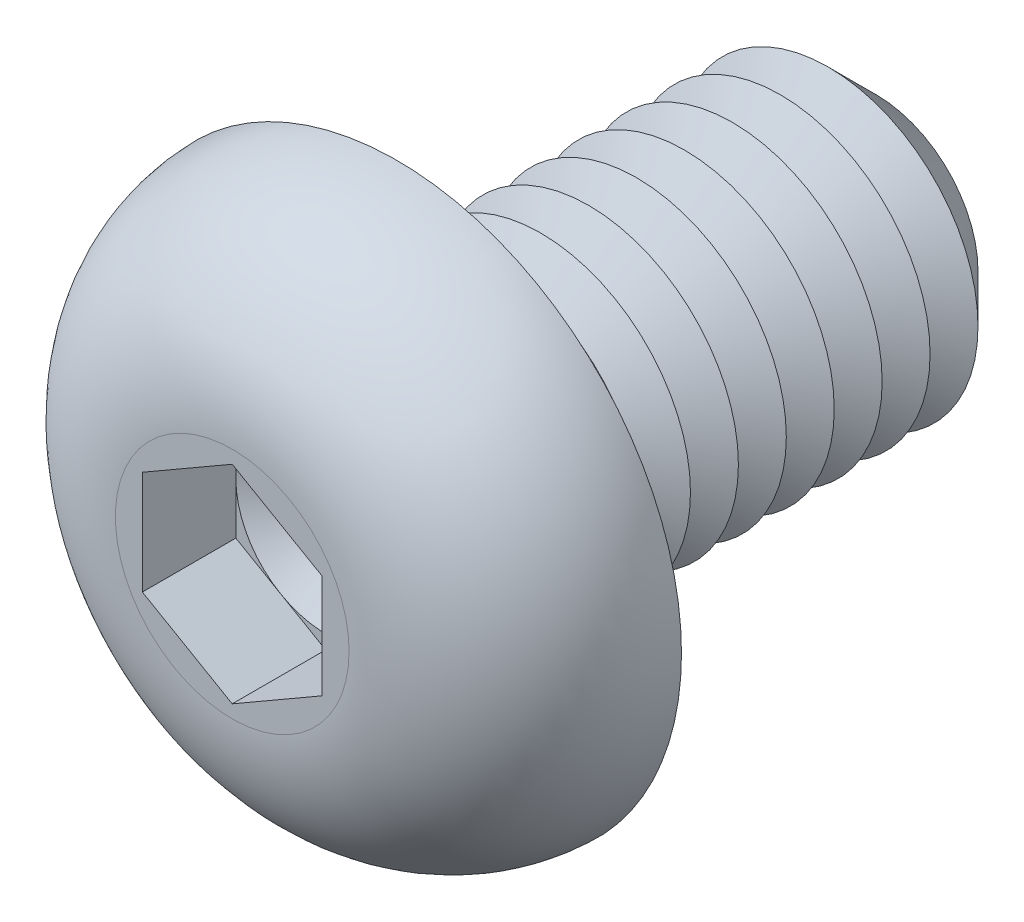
ISO-10303-21;
HEADER;
FILE_DESCRIPTION(('STEP AP214'),'2;1');
FILE_NAME('part.step','',(''),(''),'','','');
FILE_SCHEMA(('AUTOMOTIVE_DESIGN { 1 0 10303 214 1 1 1 1 }'));
ENDSEC;
DATA;
#1=APPLICATION_CONTEXT('core data for automotive mechanical design processes');
#2=APPLICATION_PROTOCOL_DEFINITION('international standard','automotive_design',2000,#1);
#3=PRODUCT_CONTEXT('',#1,'mechanical');
#4=PRODUCT('Part','Part','',(#3));
#5=PRODUCT_RELATED_PRODUCT_CATEGORY('part','',(#4));
#6=PRODUCT_DEFINITION_FORMATION('','',#4);
#7=PRODUCT_DEFINITION_CONTEXT('part definition',#1,'design');
#8=PRODUCT_DEFINITION('design','',#6,#7);
#9=PRODUCT_DEFINITION_SHAPE('','',#8);
#10=(LENGTH_UNIT() NAMED_UNIT(*) SI_UNIT(.MILLI.,.METRE.));
#11=(NAMED_UNIT(*) PLANE_ANGLE_UNIT() SI_UNIT($,.RADIAN.));
#12=(NAMED_UNIT(*) SI_UNIT($,.STERADIAN.) SOLID_ANGLE_UNIT());
#13=UNCERTAINTY_MEASURE_WITH_UNIT(LENGTH_MEASURE(1.E-05),#10,'distance_accuracy_value','');
#14=(GEOMETRIC_REPRESENTATION_CONTEXT(3) GLOBAL_UNCERTAINTY_ASSIGNED_CONTEXT((#13)) GLOBAL_UNIT_ASSIGNED_CONTEXT((#10,
#11,#12)) REPRESENTATION_CONTEXT('',''));
#15=CARTESIAN_POINT('',(0.,0.,0.));
#16=DIRECTION('',(0.,0.,1.));
#17=DIRECTION('',(1.,0.,0.));
#18=AXIS2_PLACEMENT_3D('',#15,#16,#17);
#19=CARTESIAN_POINT('',(0.,0.,1.19));
#20=DIRECTION('',(0.,0.,1.));
#21=DIRECTION('',(1.,0.,0.));
#22=AXIS2_PLACEMENT_3D('',#19,#20,#21);
#23=PLANE('',#22);
#24=CARTESIAN_POINT('',(0.,0.,1.19));
#25=DIRECTION('',(0.,0.,1.));
#26=DIRECTION('',(1.,0.,0.));
#27=AXIS2_PLACEMENT_3D('',#24,#25,#26);
#28=CIRCLE('',#27,1.5);
#29=CARTESIAN_POINT('',(1.5,0.,1.19));
#30=VERTEX_POINT('',#29);
#31=CARTESIAN_POINT('',(0.75,1.29903810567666,1.19));
#32=VERTEX_POINT('',#31);
#33=EDGE_CURVE('E117',#30,#32,#28,.T.);
#34=ORIENTED_EDGE('',*,*,#33,.F.);
#35=DIRECTION('',(0.,1.,0.));
#36=VECTOR('',#35,1.);
#37=CARTESIAN_POINT('',(1.5,-0.866025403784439,1.19));
#38=LINE('',#37,#36);
#39=CARTESIAN_POINT('',(1.5,0.86602540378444,1.19));
#40=VERTEX_POINT('',#39);
#41=EDGE_CURVE('E140',#30,#40,#38,.T.);
#42=ORIENTED_EDGE('',*,*,#41,.T.);
#43=DIRECTION('',(-0.866025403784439,0.5,0.));
#44=VECTOR('',#43,1.);
#45=CARTESIAN_POINT('',(1.5,0.86602540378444,1.19));
#46=LINE('',#45,#44);
#47=EDGE_CURVE('E135',#40,#32,#46,.T.);
#48=ORIENTED_EDGE('',*,*,#47,.T.);
#49=EDGE_LOOP('',(#34,#42,#48));
#50=FACE_BOUND('',#49,.T.);
#51=ADVANCED_FACE('F39',(#50),#23,.T.);
#52=CARTESIAN_POINT('',(0.,0.,1.19));
#53=DIRECTION('',(0.,0.,1.));
#54=DIRECTION('',(1.,0.,0.));
#55=AXIS2_PLACEMENT_3D('',#52,#53,#54);
#56=CIRCLE('',#55,1.5);
#57=CARTESIAN_POINT('',(-0.75,1.29903810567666,1.19));
#58=VERTEX_POINT('',#57);
#59=EDGE_CURVE('E11',#32,#58,#56,.T.);
#60=ORIENTED_EDGE('',*,*,#59,.F.);
#61=CARTESIAN_POINT('',(0.,1.73205080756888,1.19));
#62=VERTEX_POINT('',#61);
#63=EDGE_CURVE('E130',#32,#62,#46,.T.);
#64=ORIENTED_EDGE('',*,*,#63,.T.);
#65=DIRECTION('',(-0.866025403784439,-0.5,0.));
#66=VECTOR('',#65,1.);
#67=CARTESIAN_POINT('',(0.,1.73205080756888,1.19));
#68=LINE('',#67,#66);
#69=EDGE_CURVE('E132',#62,#58,#68,.T.);
#70=ORIENTED_EDGE('',*,*,#69,.T.);
#71=EDGE_LOOP('',(#60,#64,#70));
#72=FACE_BOUND('',#71,.T.);
#73=ADVANCED_FACE('F129',(#72),#23,.T.);
#74=CARTESIAN_POINT('',(-1.5,0.,1.19));
#75=VERTEX_POINT('',#74);
#76=EDGE_CURVE('E49',#58,#75,#56,.T.);
#77=ORIENTED_EDGE('',*,*,#76,.F.);
#78=CARTESIAN_POINT('',(-1.5,0.866025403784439,1.19));
#79=VERTEX_POINT('',#78);
#80=EDGE_CURVE('E143',#58,#79,#68,.T.);
#81=ORIENTED_EDGE('',*,*,#80,.T.);
#82=DIRECTION('',(0.,-1.,0.));
#83=VECTOR('',#82,1.);
#84=CARTESIAN_POINT('',(-1.5,0.866025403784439,1.19));
#85=LINE('',#84,#83);
#86=EDGE_CURVE('E154',#79,#75,#85,.T.);
#87=ORIENTED_EDGE('',*,*,#86,.T.);
#88=EDGE_LOOP('',(#77,#81,#87));
#89=FACE_BOUND('',#88,.T.);
#90=ADVANCED_FACE('F250',(#89),#23,.T.);
#91=CARTESIAN_POINT('',(-0.75,-1.29903810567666,1.19));
#92=VERTEX_POINT('',#91);
#93=EDGE_CURVE('E234',#75,#92,#56,.T.);
#94=ORIENTED_EDGE('',*,*,#93,.F.);
#95=CARTESIAN_POINT('',(-1.5,-0.866025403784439,1.19));
#96=VERTEX_POINT('',#95);
#97=EDGE_CURVE('E153',#75,#96,#85,.T.);
#98=ORIENTED_EDGE('',*,*,#97,.T.);
#99=DIRECTION('',(0.866025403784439,-0.5,0.));
#100=VECTOR('',#99,1.);
#101=CARTESIAN_POINT('',(-1.5,-0.866025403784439,1.19));
#102=LINE('',#101,#100);
#103=EDGE_CURVE('E159',#96,#92,#102,.T.);
#104=ORIENTED_EDGE('',*,*,#103,.T.);
#105=EDGE_LOOP('',(#94,#98,#104));
#106=FACE_BOUND('',#105,.T.);
#107=ADVANCED_FACE('F243',(#106),#23,.T.);
#108=CARTESIAN_POINT('',(0.75,-1.29903810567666,1.19));
#109=VERTEX_POINT('',#108);
#110=EDGE_CURVE('E56',#92,#109,#56,.T.);
#111=ORIENTED_EDGE('',*,*,#110,.F.);
#112=CARTESIAN_POINT('',(0.,-1.73205080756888,1.19));
#113=VERTEX_POINT('',#112);
#114=EDGE_CURVE('E158',#92,#113,#102,.T.);
#115=ORIENTED_EDGE('',*,*,#114,.T.);
#116=DIRECTION('',(0.866025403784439,0.5,0.));
#117=VECTOR('',#116,1.);
#118=CARTESIAN_POINT('',(0.,-1.73205080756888,1.19));
#119=LINE('',#118,#117);
#120=EDGE_CURVE('E164',#113,#109,#119,.T.);
#121=ORIENTED_EDGE('',*,*,#120,.T.);
#122=EDGE_LOOP('',(#111,#115,#121));
#123=FACE_BOUND('',#122,.T.);
#124=ADVANCED_FACE('F319',(#123),#23,.T.);
#125=CARTESIAN_POINT('',(0.,0.,-8.));
#126=DIRECTION('',(0.,0.,1.));
#127=DIRECTION('',(1.,0.,0.));
#128=AXIS2_PLACEMENT_3D('',#125,#126,#127);
#129=CYLINDRICAL_SURFACE('',#128,2.5);
#130=CARTESIAN_POINT('',(0.,0.,-0.4));
#131=DIRECTION('',(0.,0.,1.));
#132=DIRECTION('',(1.,0.,0.));
#133=AXIS2_PLACEMENT_3D('',#130,#131,#132);
#134=CIRCLE('',#133,2.5);
#135=CARTESIAN_POINT('',(2.5,0.,-0.4));
#136=VERTEX_POINT('',#135);
#137=EDGE_CURVE('E221',#136,#136,#134,.F.);
#138=ORIENTED_EDGE('',*,*,#137,.T.);
#139=EDGE_LOOP('',(#138));
#140=FACE_BOUND('',#139,.T.);
#141=CARTESIAN_POINT('',(0.,0.,-0.800000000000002));
#142=DIRECTION('',(0.,0.,1.));
#143=DIRECTION('',(1.,0.,0.));
#144=AXIS2_PLACEMENT_3D('',#141,#142,#143);
#145=CIRCLE('',#144,2.5);
#146=CARTESIAN_POINT('',(2.5,0.,-0.800000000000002));
#147=VERTEX_POINT('',#146);
#148=EDGE_CURVE('E149',#147,#147,#145,.T.);
#149=ORIENTED_EDGE('',*,*,#148,.T.);
#150=EDGE_LOOP('',(#149));
#151=FACE_BOUND('',#150,.T.);
#152=ADVANCED_FACE('F303',(#140,#151),#129,.T.);
#153=CARTESIAN_POINT('',(0.,4.75,0.));
#154=DIRECTION('',(0.,0.,1.));
#155=DIRECTION('',(1.,0.,0.));
#156=AXIS2_PLACEMENT_3D('',#153,#154,#155);
#157=PLANE('',#156);
#158=CARTESIAN_POINT('',(0.,0.,0.));
#159=DIRECTION('',(0.,0.,1.));
#160=DIRECTION('',(1.,0.,0.));
#161=AXIS2_PLACEMENT_3D('',#158,#159,#160);
#162=CIRCLE('',#161,2.9);
#163=CARTESIAN_POINT('',(2.9,0.,0.));
#164=VERTEX_POINT('',#163);
#165=EDGE_CURVE('E224',#164,#164,#162,.T.);
#166=ORIENTED_EDGE('',*,*,#165,.T.);
#167=EDGE_LOOP('',(#166));
#168=FACE_BOUND('',#167,.T.);
#169=CARTESIAN_POINT('',(0.,0.,0.));
#170=DIRECTION('',(0.,0.,1.));
#171=DIRECTION('',(1.,0.,0.));
#172=AXIS2_PLACEMENT_3D('',#169,#170,#171);
#173=CIRCLE('',#172,4.75);
#174=CARTESIAN_POINT('',(4.75,0.,0.));
#175=VERTEX_POINT('',#174);
#176=EDGE_CURVE('E196',#175,#175,#173,.T.);
#177=ORIENTED_EDGE('',*,*,#176,.F.);
#178=EDGE_LOOP('',(#177));
#179=FACE_BOUND('',#178,.T.);
#180=ADVANCED_FACE('F349',(#168,#179),#157,.F.);
#181=CARTESIAN_POINT('',(0.,0.,2.75));
#182=DIRECTION('',(0.,0.,-1.));
#183=DIRECTION('',(-1.,0.,0.));
#184=AXIS2_PLACEMENT_3D('',#181,#182,#183);
#185=PLANE('',#184);
#186=DIRECTION('',(-0.866025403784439,-0.5,0.));
#187=VECTOR('',#186,1.);
#188=CARTESIAN_POINT('',(0.,1.73205080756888,2.75));
#189=LINE('',#188,#187);
#190=CARTESIAN_POINT('',(0.,1.73205080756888,2.75));
#191=VERTEX_POINT('',#190);
#192=CARTESIAN_POINT('',(-1.5,0.866025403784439,2.75));
#193=VERTEX_POINT('',#192);
#194=EDGE_CURVE('E174',#191,#193,#189,.T.);
#195=ORIENTED_EDGE('',*,*,#194,.F.);
#196=DIRECTION('',(-0.866025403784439,0.5,0.));
#197=VECTOR('',#196,1.);
#198=CARTESIAN_POINT('',(1.5,0.86602540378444,2.75));
#199=LINE('',#198,#197);
#200=CARTESIAN_POINT('',(1.5,0.86602540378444,2.75));
#201=VERTEX_POINT('',#200);
#202=EDGE_CURVE('E64',#201,#191,#199,.T.);
#203=ORIENTED_EDGE('',*,*,#202,.F.);
#204=DIRECTION('',(0.,1.,0.));
#205=VECTOR('',#204,1.);
#206=CARTESIAN_POINT('',(1.5,-0.866025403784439,2.75));
#207=LINE('',#206,#205);
#208=CARTESIAN_POINT('',(1.5,-0.866025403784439,2.75));
#209=VERTEX_POINT('',#208);
#210=EDGE_CURVE('E138',#209,#201,#207,.T.);
#211=ORIENTED_EDGE('',*,*,#210,.F.);
#212=DIRECTION('',(0.866025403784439,0.5,0.));
#213=VECTOR('',#212,1.);
#214=CARTESIAN_POINT('',(0.,-1.73205080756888,2.75));
#215=LINE('',#214,#213);
#216=CARTESIAN_POINT('',(0.,-1.73205080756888,2.75));
#217=VERTEX_POINT('',#216);
#218=EDGE_CURVE('E186',#217,#209,#215,.T.);
#219=ORIENTED_EDGE('',*,*,#218,.F.);
#220=DIRECTION('',(0.866025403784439,-0.5,0.));
#221=VECTOR('',#220,1.);
#222=CARTESIAN_POINT('',(-1.5,-0.866025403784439,2.75));
#223=LINE('',#222,#221);
#224=CARTESIAN_POINT('',(-1.5,-0.866025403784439,2.75));
#225=VERTEX_POINT('',#224);
#226=EDGE_CURVE('E182',#225,#217,#223,.T.);
#227=ORIENTED_EDGE('',*,*,#226,.F.);
#228=DIRECTION('',(0.,-1.,0.));
#229=VECTOR('',#228,1.);
#230=CARTESIAN_POINT('',(-1.5,0.866025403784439,2.75));
#231=LINE('',#230,#229);
#232=EDGE_CURVE('E178',#193,#225,#231,.T.);
#233=ORIENTED_EDGE('',*,*,#232,.F.);
#234=EDGE_LOOP('',(#195,#203,#211,#219,#227,#233));
#235=FACE_BOUND('',#234,.T.);
#236=CARTESIAN_POINT('',(0.,0.,2.75));
#237=DIRECTION('',(0.,0.,1.));
#238=DIRECTION('',(1.,0.,0.));
#239=AXIS2_PLACEMENT_3D('',#236,#237,#238);
#240=CIRCLE('',#239,1.95044646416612);
#241=CARTESIAN_POINT('',(1.95044646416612,0.,2.75));
#242=VERTEX_POINT('',#241);
#243=EDGE_CURVE('E214',#242,#242,#240,.T.);
#244=ORIENTED_EDGE('',*,*,#243,.T.);
#245=EDGE_LOOP('',(#244));
#246=FACE_BOUND('',#245,.T.);
#247=ADVANCED_FACE('F259',(#235,#246),#185,.F.);
#248=CARTESIAN_POINT('',(0.,0.,-0.0500000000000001));
#249=DIRECTION('',(0.,0.,1.));
#250=DIRECTION('',(1.,0.,0.));
#251=AXIS2_PLACEMENT_3D('',#248,#249,#250);
#252=DEGENERATE_TOROIDAL_SURFACE('',#251,1.95044646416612,2.8,.T.);
#253=ORIENTED_EDGE('',*,*,#243,.F.);
#254=EDGE_LOOP('',(#253));
#255=FACE_BOUND('',#254,.T.);
#256=ORIENTED_EDGE('',*,*,#176,.T.);
#257=EDGE_LOOP('',(#256));
#258=FACE_BOUND('',#257,.T.);
#259=ADVANCED_FACE('F343',(#255,#258),#252,.T.);
#260=CARTESIAN_POINT('',(1.5,0.86602540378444,1.19));
#261=DIRECTION('',(0.5,0.866025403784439,0.));
#262=DIRECTION('',(-0.866025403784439,0.5,0.));
#263=AXIS2_PLACEMENT_3D('',#260,#261,#262);
#264=PLANE('',#263);
#265=ORIENTED_EDGE('',*,*,#202,.T.);
#266=DIRECTION('',(0.,0.,1.));
#267=VECTOR('',#266,1.);
#268=CARTESIAN_POINT('',(0.,1.73205080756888,1.19));
#269=LINE('',#268,#267);
#270=EDGE_CURVE('E136',#62,#191,#269,.T.);
#271=ORIENTED_EDGE('',*,*,#270,.F.);
#272=ORIENTED_EDGE('',*,*,#63,.F.);
#273=ORIENTED_EDGE('',*,*,#47,.F.);
#274=DIRECTION('',(0.,0.,1.));
#275=VECTOR('',#274,1.);
#276=CARTESIAN_POINT('',(1.5,0.86602540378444,1.19));
#277=LINE('',#276,#275);
#278=EDGE_CURVE('E193',#40,#201,#277,.T.);
#279=ORIENTED_EDGE('',*,*,#278,.T.);
#280=EDGE_LOOP('',(#265,#271,#272,#273,#279));
#281=FACE_BOUND('',#280,.T.);
#282=ADVANCED_FACE('F134',(#281),#264,.F.);
#283=CARTESIAN_POINT('',(1.5,-0.866025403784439,1.19));
#284=DIRECTION('',(1.,0.,0.));
#285=DIRECTION('',(0.,1.,0.));
#286=AXIS2_PLACEMENT_3D('',#283,#284,#285);
#287=PLANE('',#286);
#288=ORIENTED_EDGE('',*,*,#210,.T.);
#289=ORIENTED_EDGE('',*,*,#278,.F.);
#290=ORIENTED_EDGE('',*,*,#41,.F.);
#291=CARTESIAN_POINT('',(1.5,-0.866025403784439,1.19));
#292=VERTEX_POINT('',#291);
#293=EDGE_CURVE('E168',#292,#30,#38,.T.);
#294=ORIENTED_EDGE('',*,*,#293,.F.);
#295=DIRECTION('',(0.,0.,1.));
#296=VECTOR('',#295,1.);
#297=CARTESIAN_POINT('',(1.5,-0.866025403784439,1.19));
#298=LINE('',#297,#296);
#299=EDGE_CURVE('E197',#292,#209,#298,.T.);
#300=ORIENTED_EDGE('',*,*,#299,.T.);
#301=EDGE_LOOP('',(#288,#289,#290,#294,#300));
#302=FACE_BOUND('',#301,.T.);
#303=ADVANCED_FACE('F327',(#302),#287,.F.);
#304=CARTESIAN_POINT('',(0.,-1.73205080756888,1.19));
#305=DIRECTION('',(0.5,-0.866025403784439,0.));
#306=DIRECTION('',(0.866025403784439,0.5,0.));
#307=AXIS2_PLACEMENT_3D('',#304,#305,#306);
#308=PLANE('',#307);
#309=ORIENTED_EDGE('',*,*,#218,.T.);
#310=ORIENTED_EDGE('',*,*,#299,.F.);
#311=EDGE_CURVE('E163',#109,#292,#119,.T.);
#312=ORIENTED_EDGE('',*,*,#311,.F.);
#313=ORIENTED_EDGE('',*,*,#120,.F.);
#314=DIRECTION('',(0.,0.,1.));
#315=VECTOR('',#314,1.);
#316=CARTESIAN_POINT('',(0.,-1.73205080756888,1.19));
#317=LINE('',#316,#315);
#318=EDGE_CURVE('E200',#113,#217,#317,.T.);
#319=ORIENTED_EDGE('',*,*,#318,.T.);
#320=EDGE_LOOP('',(#309,#310,#312,#313,#319));
#321=FACE_BOUND('',#320,.T.);
#322=ADVANCED_FACE('F330',(#321),#308,.F.);
#323=CARTESIAN_POINT('',(-1.5,-0.866025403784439,1.19));
#324=DIRECTION('',(-0.5,-0.866025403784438,0.));
#325=DIRECTION('',(0.866025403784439,-0.5,0.));
#326=AXIS2_PLACEMENT_3D('',#323,#324,#325);
#327=PLANE('',#326);
#328=ORIENTED_EDGE('',*,*,#226,.T.);
#329=ORIENTED_EDGE('',*,*,#318,.F.);
#330=ORIENTED_EDGE('',*,*,#114,.F.);
#331=ORIENTED_EDGE('',*,*,#103,.F.);
#332=DIRECTION('',(0.,0.,1.));
#333=VECTOR('',#332,1.);
#334=CARTESIAN_POINT('',(-1.5,-0.866025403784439,1.19));
#335=LINE('',#334,#333);
#336=EDGE_CURVE('E203',#96,#225,#335,.T.);
#337=ORIENTED_EDGE('',*,*,#336,.T.);
#338=EDGE_LOOP('',(#328,#329,#330,#331,#337));
#339=FACE_BOUND('',#338,.T.);
#340=ADVANCED_FACE('F264',(#339),#327,.F.);
#341=CARTESIAN_POINT('',(-1.5,0.866025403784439,1.19));
#342=DIRECTION('',(-1.,0.,0.));
#343=DIRECTION('',(0.,-1.,0.));
#344=AXIS2_PLACEMENT_3D('',#341,#342,#343);
#345=PLANE('',#344);
#346=ORIENTED_EDGE('',*,*,#232,.T.);
#347=ORIENTED_EDGE('',*,*,#336,.F.);
#348=ORIENTED_EDGE('',*,*,#97,.F.);
#349=ORIENTED_EDGE('',*,*,#86,.F.);
#350=DIRECTION('',(0.,0.,1.));
#351=VECTOR('',#350,1.);
#352=CARTESIAN_POINT('',(-1.5,0.866025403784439,1.19));
#353=LINE('',#352,#351);
#354=EDGE_CURVE('E206',#79,#193,#353,.T.);
#355=ORIENTED_EDGE('',*,*,#354,.T.);
#356=EDGE_LOOP('',(#346,#347,#348,#349,#355));
#357=FACE_BOUND('',#356,.T.);
#358=ADVANCED_FACE('F248',(#357),#345,.F.);
#359=CARTESIAN_POINT('',(0.,1.73205080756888,1.19));
#360=DIRECTION('',(-0.5,0.866025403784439,0.));
#361=DIRECTION('',(-0.866025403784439,-0.5,0.));
#362=AXIS2_PLACEMENT_3D('',#359,#360,#361);
#363=PLANE('',#362);
#364=ORIENTED_EDGE('',*,*,#194,.T.);
#365=ORIENTED_EDGE('',*,*,#354,.F.);
#366=ORIENTED_EDGE('',*,*,#80,.F.);
#367=ORIENTED_EDGE('',*,*,#69,.F.);
#368=ORIENTED_EDGE('',*,*,#270,.T.);
#369=EDGE_LOOP('',(#364,#365,#366,#367,#368));
#370=FACE_BOUND('',#369,.T.);
#371=ADVANCED_FACE('F253',(#370),#363,.F.);
#372=EDGE_CURVE('E43',#109,#30,#56,.T.);
#373=ORIENTED_EDGE('',*,*,#372,.F.);
#374=ORIENTED_EDGE('',*,*,#311,.T.);
#375=ORIENTED_EDGE('',*,*,#293,.T.);
#376=EDGE_LOOP('',(#373,#374,#375));
#377=FACE_BOUND('',#376,.T.);
#378=ADVANCED_FACE('F308',(#377),#23,.T.);
#379=CARTESIAN_POINT('',(0.,0.,-0.800000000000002));
#380=DIRECTION('',(0.,0.,1.));
#381=DIRECTION('',(1.,0.,0.));
#382=AXIS2_PLACEMENT_3D('',#379,#380,#381);
#383=CONICAL_SURFACE('',#382,2.5,1.0471975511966);
#384=CARTESIAN_POINT('',(0.,0.,-1.2));
#385=DIRECTION('',(0.,0.,1.));
#386=DIRECTION('',(1.,0.,0.));
#387=AXIS2_PLACEMENT_3D('',#384,#385,#386);
#388=CIRCLE('',#387,1.80717967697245);
#389=CARTESIAN_POINT('',(1.80717967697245,0.,-1.2));
#390=VERTEX_POINT('',#389);
#391=EDGE_CURVE('E294',#390,#390,#388,.T.);
#392=ORIENTED_EDGE('',*,*,#391,.T.);
#393=EDGE_LOOP('',(#392));
#394=FACE_BOUND('',#393,.T.);
#395=ORIENTED_EDGE('',*,*,#148,.F.);
#396=EDGE_LOOP('',(#395));
#397=FACE_BOUND('',#396,.T.);
#398=ADVANCED_FACE('F305',(#394,#397),#383,.T.);
#399=CARTESIAN_POINT('',(0.,0.,-1.2));
#400=DIRECTION('',(0.,0.,-1.));
#401=DIRECTION('',(-1.,0.,0.));
#402=AXIS2_PLACEMENT_3D('',#399,#400,#401);
#403=CONICAL_SURFACE('',#402,1.80717967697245,1.04719755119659);
#404=CARTESIAN_POINT('',(0.,0.,-1.6));
#405=DIRECTION('',(0.,0.,1.));
#406=DIRECTION('',(1.,0.,0.));
#407=AXIS2_PLACEMENT_3D('',#404,#405,#406);
#408=CIRCLE('',#407,2.5);
#409=CARTESIAN_POINT('',(2.5,0.,-1.6));
#410=VERTEX_POINT('',#409);
#411=EDGE_CURVE('E287',#410,#410,#408,.T.);
#412=ORIENTED_EDGE('',*,*,#411,.T.);
#413=EDGE_LOOP('',(#412));
#414=FACE_BOUND('',#413,.T.);
#415=ORIENTED_EDGE('',*,*,#391,.F.);
#416=EDGE_LOOP('',(#415));
#417=FACE_BOUND('',#416,.T.);
#418=ADVANCED_FACE('F307',(#414,#417),#403,.T.);
#419=CARTESIAN_POINT('',(0.,0.,-1.6));
#420=DIRECTION('',(0.,0.,1.));
#421=DIRECTION('',(1.,0.,0.));
#422=AXIS2_PLACEMENT_3D('',#419,#420,#421);
#423=CONICAL_SURFACE('',#422,2.5,1.0471975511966);
#424=CARTESIAN_POINT('',(0.,0.,-2.));
#425=DIRECTION('',(0.,0.,1.));
#426=DIRECTION('',(1.,0.,0.));
#427=AXIS2_PLACEMENT_3D('',#424,#425,#426);
#428=CIRCLE('',#427,1.80717967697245);
#429=CARTESIAN_POINT('',(1.80717967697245,0.,-2.));
#430=VERTEX_POINT('',#429);
#431=EDGE_CURVE('E282',#430,#430,#428,.T.);
#432=ORIENTED_EDGE('',*,*,#431,.T.);
#433=EDGE_LOOP('',(#432));
#434=FACE_BOUND('',#433,.T.);
#435=ORIENTED_EDGE('',*,*,#411,.F.);
#436=EDGE_LOOP('',(#435));
#437=FACE_BOUND('',#436,.T.);
#438=ADVANCED_FACE('F314',(#434,#437),#423,.T.);
#439=CARTESIAN_POINT('',(0.,0.,-2.));
#440=DIRECTION('',(0.,0.,-1.));
#441=DIRECTION('',(-1.,0.,0.));
#442=AXIS2_PLACEMENT_3D('',#439,#440,#441);
#443=CONICAL_SURFACE('',#442,1.80717967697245,1.04719755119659);
#444=CARTESIAN_POINT('',(0.,0.,-2.4));
#445=DIRECTION('',(0.,0.,1.));
#446=DIRECTION('',(1.,0.,0.));
#447=AXIS2_PLACEMENT_3D('',#444,#445,#446);
#448=CIRCLE('',#447,2.5);
#449=CARTESIAN_POINT('',(2.5,0.,-2.4));
#450=VERTEX_POINT('',#449);
#451=EDGE_CURVE('E280',#450,#450,#448,.T.);
#452=ORIENTED_EDGE('',*,*,#451,.T.);
#453=EDGE_LOOP('',(#452));
#454=FACE_BOUND('',#453,.T.);
#455=ORIENTED_EDGE('',*,*,#431,.F.);
#456=EDGE_LOOP('',(#455));
#457=FACE_BOUND('',#456,.T.);
#458=ADVANCED_FACE('F425',(#454,#457),#443,.T.);
#459=CARTESIAN_POINT('',(0.,0.,-2.4));
#460=DIRECTION('',(0.,0.,1.));
#461=DIRECTION('',(1.,0.,0.));
#462=AXIS2_PLACEMENT_3D('',#459,#460,#461);
#463=CONICAL_SURFACE('',#462,2.5,1.0471975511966);
#464=CARTESIAN_POINT('',(0.,0.,-2.8));
#465=DIRECTION('',(0.,0.,1.));
#466=DIRECTION('',(1.,0.,0.));
#467=AXIS2_PLACEMENT_3D('',#464,#465,#466);
#468=CIRCLE('',#467,1.80717967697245);
#469=CARTESIAN_POINT('',(1.80717967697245,0.,-2.8));
#470=VERTEX_POINT('',#469);
#471=EDGE_CURVE('E278',#470,#470,#468,.T.);
#472=ORIENTED_EDGE('',*,*,#471,.T.);
#473=EDGE_LOOP('',(#472));
#474=FACE_BOUND('',#473,.T.);
#475=ORIENTED_EDGE('',*,*,#451,.F.);
#476=EDGE_LOOP('',(#475));
#477=FACE_BOUND('',#476,.T.);
#478=ADVANCED_FACE('F421',(#474,#477),#463,.T.);
#479=CARTESIAN_POINT('',(0.,0.,-2.8));
#480=DIRECTION('',(0.,0.,-1.));
#481=DIRECTION('',(-1.,0.,0.));
#482=AXIS2_PLACEMENT_3D('',#479,#480,#481);
#483=CONICAL_SURFACE('',#482,1.80717967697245,1.04719755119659);
#484=CARTESIAN_POINT('',(0.,0.,-3.2));
#485=DIRECTION('',(0.,0.,1.));
#486=DIRECTION('',(1.,0.,0.));
#487=AXIS2_PLACEMENT_3D('',#484,#485,#486);
#488=CIRCLE('',#487,2.5);
#489=CARTESIAN_POINT('',(2.5,0.,-3.2));
#490=VERTEX_POINT('',#489);
#491=EDGE_CURVE('E276',#490,#490,#488,.T.);
#492=ORIENTED_EDGE('',*,*,#491,.T.);
#493=EDGE_LOOP('',(#492));
#494=FACE_BOUND('',#493,.T.);
#495=ORIENTED_EDGE('',*,*,#471,.F.);
#496=EDGE_LOOP('',(#495));
#497=FACE_BOUND('',#496,.T.);
#498=ADVANCED_FACE('F415',(#494,#497),#483,.T.);
#499=CARTESIAN_POINT('',(0.,0.,-3.2));
#500=DIRECTION('',(0.,0.,1.));
#501=DIRECTION('',(1.,0.,0.));
#502=AXIS2_PLACEMENT_3D('',#499,#500,#501);
#503=CONICAL_SURFACE('',#502,2.5,1.0471975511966);
#504=CARTESIAN_POINT('',(0.,0.,-3.6));
#505=DIRECTION('',(0.,0.,1.));
#506=DIRECTION('',(1.,0.,0.));
#507=AXIS2_PLACEMENT_3D('',#504,#505,#506);
#508=CIRCLE('',#507,1.80717967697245);
#509=CARTESIAN_POINT('',(1.80717967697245,0.,-3.6));
#510=VERTEX_POINT('',#509);
#511=EDGE_CURVE('E273',#510,#510,#508,.T.);
#512=ORIENTED_EDGE('',*,*,#511,.T.);
#513=EDGE_LOOP('',(#512));
#514=FACE_BOUND('',#513,.T.);
#515=ORIENTED_EDGE('',*,*,#491,.F.);
#516=EDGE_LOOP('',(#515));
#517=FACE_BOUND('',#516,.T.);
#518=ADVANCED_FACE('F400',(#514,#517),#503,.T.);
#519=CARTESIAN_POINT('',(0.,0.,-3.6));
#520=DIRECTION('',(0.,0.,-1.));
#521=DIRECTION('',(-1.,0.,0.));
#522=AXIS2_PLACEMENT_3D('',#519,#520,#521);
#523=CONICAL_SURFACE('',#522,1.80717967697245,1.04719755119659);
#524=CARTESIAN_POINT('',(0.,0.,-4.));
#525=DIRECTION('',(0.,0.,1.));
#526=DIRECTION('',(1.,0.,0.));
#527=AXIS2_PLACEMENT_3D('',#524,#525,#526);
#528=CIRCLE('',#527,2.5);
#529=CARTESIAN_POINT('',(2.5,0.,-4.));
#530=VERTEX_POINT('',#529);
#531=EDGE_CURVE('E270',#530,#530,#528,.T.);
#532=ORIENTED_EDGE('',*,*,#531,.T.);
#533=EDGE_LOOP('',(#532));
#534=FACE_BOUND('',#533,.T.);
#535=ORIENTED_EDGE('',*,*,#511,.F.);
#536=EDGE_LOOP('',(#535));
#537=FACE_BOUND('',#536,.T.);
#538=ADVANCED_FACE('F403',(#534,#537),#523,.T.);
#539=CARTESIAN_POINT('',(0.,0.,-4.));
#540=DIRECTION('',(0.,0.,1.));
#541=DIRECTION('',(1.,0.,0.));
#542=AXIS2_PLACEMENT_3D('',#539,#540,#541);
#543=CONICAL_SURFACE('',#542,2.5,1.0471975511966);
#544=CARTESIAN_POINT('',(0.,0.,-4.4));
#545=DIRECTION('',(0.,0.,1.));
#546=DIRECTION('',(1.,0.,0.));
#547=AXIS2_PLACEMENT_3D('',#544,#545,#546);
#548=CIRCLE('',#547,1.80717967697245);
#549=CARTESIAN_POINT('',(1.80717967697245,0.,-4.4));
#550=VERTEX_POINT('',#549);
#551=EDGE_CURVE('E274',#550,#550,#548,.T.);
#552=ORIENTED_EDGE('',*,*,#551,.T.);
#553=EDGE_LOOP('',(#552));
#554=FACE_BOUND('',#553,.T.);
#555=ORIENTED_EDGE('',*,*,#531,.F.);
#556=EDGE_LOOP('',(#555));
#557=FACE_BOUND('',#556,.T.);
#558=ADVANCED_FACE('F405',(#554,#557),#543,.T.);
#559=CARTESIAN_POINT('',(0.,0.,-4.4));
#560=DIRECTION('',(0.,0.,-1.));
#561=DIRECTION('',(-1.,0.,0.));
#562=AXIS2_PLACEMENT_3D('',#559,#560,#561);
#563=CONICAL_SURFACE('',#562,1.80717967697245,1.04719755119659);
#564=CARTESIAN_POINT('',(0.,0.,-4.8));
#565=DIRECTION('',(0.,0.,1.));
#566=DIRECTION('',(1.,0.,0.));
#567=AXIS2_PLACEMENT_3D('',#564,#565,#566);
#568=CIRCLE('',#567,2.5);
#569=CARTESIAN_POINT('',(2.5,0.,-4.8));
#570=VERTEX_POINT('',#569);
#571=EDGE_CURVE('E390',#570,#570,#568,.T.);
#572=ORIENTED_EDGE('',*,*,#571,.T.);
#573=EDGE_LOOP('',(#572));
#574=FACE_BOUND('',#573,.T.);
#575=ORIENTED_EDGE('',*,*,#551,.F.);
#576=EDGE_LOOP('',(#575));
#577=FACE_BOUND('',#576,.T.);
#578=ADVANCED_FACE('F412',(#574,#577),#563,.T.);
#579=CARTESIAN_POINT('',(0.,0.,-4.8));
#580=DIRECTION('',(0.,0.,1.));
#581=DIRECTION('',(1.,0.,0.));
#582=AXIS2_PLACEMENT_3D('',#579,#580,#581);
#583=CONICAL_SURFACE('',#582,2.5,1.0471975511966);
#584=CARTESIAN_POINT('',(0.,0.,-5.2));
#585=DIRECTION('',(0.,0.,1.));
#586=DIRECTION('',(1.,0.,0.));
#587=AXIS2_PLACEMENT_3D('',#584,#585,#586);
#588=CIRCLE('',#587,1.80717967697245);
#589=CARTESIAN_POINT('',(1.80717967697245,0.,-5.2));
#590=VERTEX_POINT('',#589);
#591=EDGE_CURVE('E387',#590,#590,#588,.T.);
#592=ORIENTED_EDGE('',*,*,#591,.T.);
#593=EDGE_LOOP('',(#592));
#594=FACE_BOUND('',#593,.T.);
#595=ORIENTED_EDGE('',*,*,#571,.F.);
#596=EDGE_LOOP('',(#595));
#597=FACE_BOUND('',#596,.T.);
#598=ADVANCED_FACE('F467',(#594,#597),#583,.T.);
#599=CARTESIAN_POINT('',(0.,0.,-5.2));
#600=DIRECTION('',(0.,0.,-1.));
#601=DIRECTION('',(-1.,0.,0.));
#602=AXIS2_PLACEMENT_3D('',#599,#600,#601);
#603=CONICAL_SURFACE('',#602,1.80717967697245,1.04719755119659);
#604=CARTESIAN_POINT('',(0.,0.,-5.6));
#605=DIRECTION('',(0.,0.,1.));
#606=DIRECTION('',(1.,0.,0.));
#607=AXIS2_PLACEMENT_3D('',#604,#605,#606);
#608=CIRCLE('',#607,2.5);
#609=CARTESIAN_POINT('',(2.5,0.,-5.6));
#610=VERTEX_POINT('',#609);
#611=EDGE_CURVE('E383',#610,#610,#608,.T.);
#612=ORIENTED_EDGE('',*,*,#611,.T.);
#613=EDGE_LOOP('',(#612));
#614=FACE_BOUND('',#613,.T.);
#615=ORIENTED_EDGE('',*,*,#591,.F.);
#616=EDGE_LOOP('',(#615));
#617=FACE_BOUND('',#616,.T.);
#618=ADVANCED_FACE('F475',(#614,#617),#603,.T.);
#619=CARTESIAN_POINT('',(0.,0.,-5.6));
#620=DIRECTION('',(0.,0.,1.));
#621=DIRECTION('',(1.,0.,0.));
#622=AXIS2_PLACEMENT_3D('',#619,#620,#621);
#623=CONICAL_SURFACE('',#622,2.5,1.0471975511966);
#624=CARTESIAN_POINT('',(0.,0.,-6.));
#625=DIRECTION('',(0.,0.,1.));
#626=DIRECTION('',(1.,0.,0.));
#627=AXIS2_PLACEMENT_3D('',#624,#625,#626);
#628=CIRCLE('',#627,1.80717967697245);
#629=CARTESIAN_POINT('',(1.80717967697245,0.,-6.));
#630=VERTEX_POINT('',#629);
#631=EDGE_CURVE('E375',#630,#630,#628,.T.);
#632=ORIENTED_EDGE('',*,*,#631,.T.);
#633=EDGE_LOOP('',(#632));
#634=FACE_BOUND('',#633,.T.);
#635=ORIENTED_EDGE('',*,*,#611,.F.);
#636=EDGE_LOOP('',(#635));
#637=FACE_BOUND('',#636,.T.);
#638=ADVANCED_FACE('F484',(#634,#637),#623,.T.);
#639=CARTESIAN_POINT('',(0.,0.,-6.));
#640=DIRECTION('',(0.,0.,-1.));
#641=DIRECTION('',(-1.,0.,0.));
#642=AXIS2_PLACEMENT_3D('',#639,#640,#641);
#643=CONICAL_SURFACE('',#642,1.80717967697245,1.04719755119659);
#644=CARTESIAN_POINT('',(0.,0.,-6.4));
#645=DIRECTION('',(0.,0.,1.));
#646=DIRECTION('',(1.,0.,0.));
#647=AXIS2_PLACEMENT_3D('',#644,#645,#646);
#648=CIRCLE('',#647,2.5);
#649=CARTESIAN_POINT('',(2.5,0.,-6.4));
#650=VERTEX_POINT('',#649);
#651=EDGE_CURVE('E369',#650,#650,#648,.T.);
#652=ORIENTED_EDGE('',*,*,#651,.T.);
#653=EDGE_LOOP('',(#652));
#654=FACE_BOUND('',#653,.T.);
#655=ORIENTED_EDGE('',*,*,#631,.F.);
#656=EDGE_LOOP('',(#655));
#657=FACE_BOUND('',#656,.T.);
#658=ADVANCED_FACE('F493',(#654,#657),#643,.T.);
#659=CARTESIAN_POINT('',(0.,0.,-6.4));
#660=DIRECTION('',(0.,0.,1.));
#661=DIRECTION('',(1.,0.,0.));
#662=AXIS2_PLACEMENT_3D('',#659,#660,#661);
#663=CONICAL_SURFACE('',#662,2.5,1.0471975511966);
#664=CARTESIAN_POINT('',(0.,0.,-6.8));
#665=DIRECTION('',(0.,0.,1.));
#666=DIRECTION('',(1.,0.,0.));
#667=AXIS2_PLACEMENT_3D('',#664,#665,#666);
#668=CIRCLE('',#667,1.80717967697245);
#669=CARTESIAN_POINT('',(1.80717967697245,0.,-6.8));
#670=VERTEX_POINT('',#669);
#671=EDGE_CURVE('E124',#670,#670,#668,.T.);
#672=ORIENTED_EDGE('',*,*,#671,.T.);
#673=EDGE_LOOP('',(#672));
#674=FACE_BOUND('',#673,.T.);
#675=ORIENTED_EDGE('',*,*,#651,.F.);
#676=EDGE_LOOP('',(#675));
#677=FACE_BOUND('',#676,.T.);
#678=ADVANCED_FACE('F502',(#674,#677),#663,.T.);
#679=CARTESIAN_POINT('',(0.,0.,-6.8));
#680=DIRECTION('',(0.,0.,-1.));
#681=DIRECTION('',(-1.,0.,0.));
#682=AXIS2_PLACEMENT_3D('',#679,#680,#681);
#683=CONICAL_SURFACE('',#682,1.80717967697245,1.04719755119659);
#684=CARTESIAN_POINT('',(0.,0.,-7.2));
#685=DIRECTION('',(0.,0.,1.));
#686=DIRECTION('',(1.,0.,0.));
#687=AXIS2_PLACEMENT_3D('',#684,#685,#686);
#688=CIRCLE('',#687,2.5);
#689=CARTESIAN_POINT('',(2.5,0.,-7.2));
#690=VERTEX_POINT('',#689);
#691=EDGE_CURVE('E365',#690,#690,#688,.T.);
#692=ORIENTED_EDGE('',*,*,#691,.T.);
#693=EDGE_LOOP('',(#692));
#694=FACE_BOUND('',#693,.T.);
#695=ORIENTED_EDGE('',*,*,#671,.F.);
#696=EDGE_LOOP('',(#695));
#697=FACE_BOUND('',#696,.T.);
#698=ADVANCED_FACE('F360',(#694,#697),#683,.T.);
#699=CARTESIAN_POINT('',(0.,0.,-8.));
#700=DIRECTION('',(0.,0.,-1.));
#701=DIRECTION('',(-1.,0.,0.));
#702=AXIS2_PLACEMENT_3D('',#699,#700,#701);
#703=PLANE('',#702);
#704=CARTESIAN_POINT('',(0.,0.,-8.));
#705=DIRECTION('',(0.,0.,-1.));
#706=DIRECTION('',(-1.,0.,0.));
#707=AXIS2_PLACEMENT_3D('',#704,#705,#706);
#708=CIRCLE('',#707,1.7);
#709=CARTESIAN_POINT('',(-1.7,0.,-8.));
#710=VERTEX_POINT('',#709);
#711=EDGE_CURVE('E218',#710,#710,#708,.T.);
#712=ORIENTED_EDGE('',*,*,#711,.T.);
#713=EDGE_LOOP('',(#712));
#714=FACE_BOUND('',#713,.T.);
#715=ADVANCED_FACE('F353',(#714),#703,.T.);
#716=CARTESIAN_POINT('',(0.,0.,-8.));
#717=DIRECTION('',(0.,0.,1.));
#718=DIRECTION('',(1.,0.,0.));
#719=AXIS2_PLACEMENT_3D('',#716,#717,#718);
#720=CONICAL_SURFACE('',#719,1.7,0.785398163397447);
#721=ORIENTED_EDGE('',*,*,#691,.F.);
#722=EDGE_LOOP('',(#721));
#723=FACE_BOUND('',#722,.T.);
#724=ORIENTED_EDGE('',*,*,#711,.F.);
#725=EDGE_LOOP('',(#724));
#726=FACE_BOUND('',#725,.T.);
#727=ADVANCED_FACE('F351',(#723,#726),#720,.T.);
#728=CARTESIAN_POINT('',(0.,0.,-0.4));
#729=DIRECTION('',(0.,0.,1.));
#730=DIRECTION('',(1.,0.,0.));
#731=AXIS2_PLACEMENT_3D('',#728,#729,#730);
#732=TOROIDAL_SURFACE('',#731,2.9,0.4);
#733=ORIENTED_EDGE('',*,*,#165,.F.);
#734=EDGE_LOOP('',(#733));
#735=FACE_BOUND('',#734,.T.);
#736=ORIENTED_EDGE('',*,*,#137,.F.);
#737=EDGE_LOOP('',(#736));
#738=FACE_BOUND('',#737,.T.);
#739=ADVANCED_FACE('F41',(#735,#738),#732,.F.);
#740=CARTESIAN_POINT('',(0.,0.,1.19));
#741=DIRECTION('',(0.,0.,1.));
#742=DIRECTION('',(1.,0.,0.));
#743=AXIS2_PLACEMENT_3D('',#740,#741,#742);
#744=CONICAL_SURFACE('',#743,1.5,1.0471975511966);
#745=CARTESIAN_POINT('',(0.,0.,0.323974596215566));
#746=VERTEX_POINT('',#745);
#747=VERTEX_LOOP('',#746);
#748=FACE_BOUND('',#747,.T.);
#749=ORIENTED_EDGE('',*,*,#33,.T.);
#750=ORIENTED_EDGE('',*,*,#59,.T.);
#751=ORIENTED_EDGE('',*,*,#76,.T.);
#752=ORIENTED_EDGE('',*,*,#93,.T.);
#753=ORIENTED_EDGE('',*,*,#110,.T.);
#754=ORIENTED_EDGE('',*,*,#372,.T.);
#755=EDGE_LOOP('',(#749,#750,#751,#752,#753,#754));
#756=FACE_BOUND('',#755,.T.);
#757=ADVANCED_FACE('F113',(#748,#756),#744,.F.);
#758=CLOSED_SHELL('',(#51,#73,#90,#107,#124,#152,#180,#247,#259,#282,#303,#322,#340,#358,#371,
#378,#398,#418,#438,#458,#478,#498,#518,#538,#558,#578,#598,#618,#638,#658,#678,#698,#715,#727,
#739,#757));
#759=MANIFOLD_SOLID_BREP('B2',#758);
#760=ADVANCED_BREP_SHAPE_REPRESENTATION('',(#18,#759),#14);
#761=SHAPE_DEFINITION_REPRESENTATION(#9,#760);
ENDSEC;
END-ISO-10303-21;
